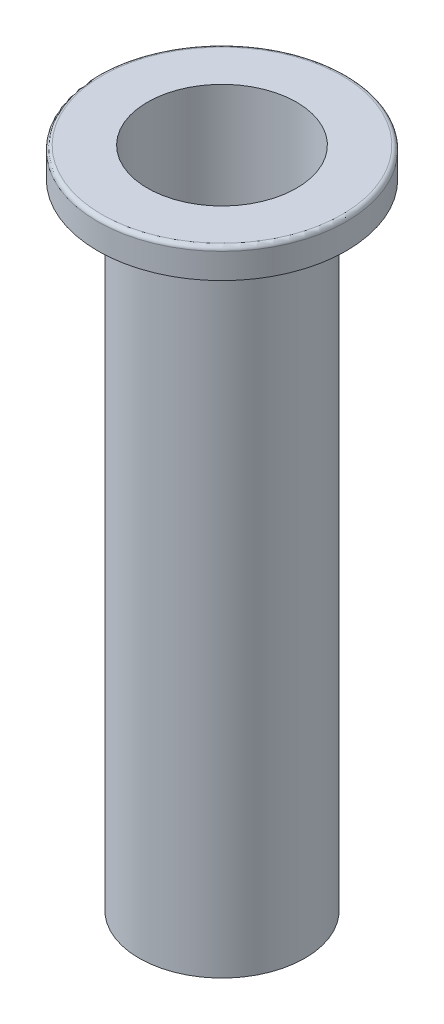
ISO-10303-21;
HEADER;
FILE_DESCRIPTION(('STEP AP214'),'2;1');
FILE_NAME('part.step','',(''),(''),'','','');
FILE_SCHEMA(('AUTOMOTIVE_DESIGN { 1 0 10303 214 1 1 1 1 }'));
ENDSEC;
DATA;
#1=APPLICATION_CONTEXT('core data for automotive mechanical design processes');
#2=APPLICATION_PROTOCOL_DEFINITION('international standard','automotive_design',2000,#1);
#3=PRODUCT_CONTEXT('',#1,'mechanical');
#4=PRODUCT('Part','Part','',(#3));
#5=PRODUCT_RELATED_PRODUCT_CATEGORY('part','',(#4));
#6=PRODUCT_DEFINITION_FORMATION('','',#4);
#7=PRODUCT_DEFINITION_CONTEXT('part definition',#1,'design');
#8=PRODUCT_DEFINITION('design','',#6,#7);
#9=PRODUCT_DEFINITION_SHAPE('','',#8);
#10=(LENGTH_UNIT() NAMED_UNIT(*) SI_UNIT(.MILLI.,.METRE.));
#11=(NAMED_UNIT(*) PLANE_ANGLE_UNIT() SI_UNIT($,.RADIAN.));
#12=(NAMED_UNIT(*) SI_UNIT($,.STERADIAN.) SOLID_ANGLE_UNIT());
#13=UNCERTAINTY_MEASURE_WITH_UNIT(LENGTH_MEASURE(1.E-05),#10,'distance_accuracy_value','');
#14=(GEOMETRIC_REPRESENTATION_CONTEXT(3) GLOBAL_UNCERTAINTY_ASSIGNED_CONTEXT((#13)) GLOBAL_UNIT_ASSIGNED_CONTEXT((#10,
#11,#12)) REPRESENTATION_CONTEXT('',''));
#15=CARTESIAN_POINT('',(0.,0.,0.));
#16=DIRECTION('',(0.,0.,1.));
#17=DIRECTION('',(1.,0.,0.));
#18=AXIS2_PLACEMENT_3D('',#15,#16,#17);
#19=CARTESIAN_POINT('',(0.,-150.,0.));
#20=DIRECTION('',(0.,1.,0.));
#21=DIRECTION('',(0.,0.,1.));
#22=AXIS2_PLACEMENT_3D('',#19,#20,#21);
#23=CYLINDRICAL_SURFACE('',#22,20.);
#24=CARTESIAN_POINT('',(0.,-150.,0.));
#25=DIRECTION('',(0.,1.,0.));
#26=DIRECTION('',(0.,0.,1.));
#27=AXIS2_PLACEMENT_3D('',#24,#25,#26);
#28=CIRCLE('',#27,20.);
#29=CARTESIAN_POINT('',(0.,-150.,20.));
#30=VERTEX_POINT('',#29);
#31=EDGE_CURVE('E51',#30,#30,#28,.T.);
#32=ORIENTED_EDGE('',*,*,#31,.T.);
#33=EDGE_LOOP('',(#32));
#34=FACE_BOUND('',#33,.T.);
#35=CARTESIAN_POINT('',(0.,0.,0.));
#36=DIRECTION('',(0.,1.,0.));
#37=DIRECTION('',(0.,0.,1.));
#38=AXIS2_PLACEMENT_3D('',#35,#36,#37);
#39=CIRCLE('',#38,20.);
#40=CARTESIAN_POINT('',(0.,0.,20.));
#41=VERTEX_POINT('',#40);
#42=EDGE_CURVE('E52',#41,#41,#39,.T.);
#43=ORIENTED_EDGE('',*,*,#42,.F.);
#44=EDGE_LOOP('',(#43));
#45=FACE_BOUND('',#44,.T.);
#46=ADVANCED_FACE('F31',(#34,#45),#23,.T.);
#47=CARTESIAN_POINT('',(0.,-150.,0.));
#48=DIRECTION('',(0.,1.,0.));
#49=DIRECTION('',(0.,0.,1.));
#50=AXIS2_PLACEMENT_3D('',#47,#48,#49);
#51=PLANE('',#50);
#52=CARTESIAN_POINT('',(0.,-150.,0.));
#53=DIRECTION('',(0.,-1.,0.));
#54=DIRECTION('',(0.,0.,-1.));
#55=AXIS2_PLACEMENT_3D('',#52,#53,#54);
#56=CIRCLE('',#55,18.);
#57=CARTESIAN_POINT('',(0.,-150.,-18.));
#58=VERTEX_POINT('',#57);
#59=EDGE_CURVE('E58',#58,#58,#56,.T.);
#60=ORIENTED_EDGE('',*,*,#59,.F.);
#61=EDGE_LOOP('',(#60));
#62=FACE_BOUND('',#61,.T.);
#63=ORIENTED_EDGE('',*,*,#31,.F.);
#64=EDGE_LOOP('',(#63));
#65=FACE_BOUND('',#64,.T.);
#66=ADVANCED_FACE('F74',(#62,#65),#51,.F.);
#67=CARTESIAN_POINT('',(0.,10.,0.));
#68=DIRECTION('',(0.,-1.,0.));
#69=DIRECTION('',(0.,0.,-1.));
#70=AXIS2_PLACEMENT_3D('',#67,#68,#69);
#71=CYLINDRICAL_SURFACE('',#70,30.);
#72=CARTESIAN_POINT('',(0.,9.,0.));
#73=DIRECTION('',(0.,1.,0.));
#74=DIRECTION('',(0.,0.,1.));
#75=AXIS2_PLACEMENT_3D('',#72,#73,#74);
#76=CIRCLE('',#75,30.);
#77=CARTESIAN_POINT('',(0.,9.,30.));
#78=VERTEX_POINT('',#77);
#79=EDGE_CURVE('E10',#78,#78,#76,.F.);
#80=ORIENTED_EDGE('',*,*,#79,.T.);
#81=EDGE_LOOP('',(#80));
#82=FACE_BOUND('',#81,.T.);
#83=CARTESIAN_POINT('',(0.,2.88675134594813,0.));
#84=DIRECTION('',(0.,1.,0.));
#85=DIRECTION('',(0.,0.,1.));
#86=AXIS2_PLACEMENT_3D('',#83,#84,#85);
#87=CIRCLE('',#86,30.);
#88=CARTESIAN_POINT('',(0.,2.88675134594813,30.));
#89=VERTEX_POINT('',#88);
#90=EDGE_CURVE('E46',#89,#89,#87,.T.);
#91=ORIENTED_EDGE('',*,*,#90,.T.);
#92=EDGE_LOOP('',(#91));
#93=FACE_BOUND('',#92,.T.);
#94=ADVANCED_FACE('F77',(#82,#93),#71,.T.);
#95=CARTESIAN_POINT('',(0.,10.,0.));
#96=DIRECTION('',(0.,1.,0.));
#97=DIRECTION('',(0.,0.,1.));
#98=AXIS2_PLACEMENT_3D('',#95,#96,#97);
#99=PLANE('',#98);
#100=CARTESIAN_POINT('',(0.,10.,0.));
#101=DIRECTION('',(0.,1.,0.));
#102=DIRECTION('',(0.,0.,1.));
#103=AXIS2_PLACEMENT_3D('',#100,#101,#102);
#104=CIRCLE('',#103,29.);
#105=CARTESIAN_POINT('',(0.,10.,29.));
#106=VERTEX_POINT('',#105);
#107=EDGE_CURVE('E38',#106,#106,#104,.T.);
#108=ORIENTED_EDGE('',*,*,#107,.T.);
#109=EDGE_LOOP('',(#108));
#110=FACE_BOUND('',#109,.T.);
#111=CARTESIAN_POINT('',(0.,10.,0.));
#112=DIRECTION('',(0.,-1.,0.));
#113=DIRECTION('',(0.,0.,-1.));
#114=AXIS2_PLACEMENT_3D('',#111,#112,#113);
#115=CIRCLE('',#114,18.);
#116=CARTESIAN_POINT('',(0.,10.,-18.));
#117=VERTEX_POINT('',#116);
#118=EDGE_CURVE('E55',#117,#117,#115,.T.);
#119=ORIENTED_EDGE('',*,*,#118,.T.);
#120=EDGE_LOOP('',(#119));
#121=FACE_BOUND('',#120,.T.);
#122=ADVANCED_FACE('F64',(#110,#121),#99,.T.);
#123=CARTESIAN_POINT('',(0.,0.,0.));
#124=DIRECTION('',(0.,1.,0.));
#125=DIRECTION('',(0.,0.,1.));
#126=AXIS2_PLACEMENT_3D('',#123,#124,#125);
#127=PLANE('',#126);
#128=CARTESIAN_POINT('',(0.,0.,0.));
#129=DIRECTION('',(0.,1.,0.));
#130=DIRECTION('',(0.,0.,1.));
#131=AXIS2_PLACEMENT_3D('',#128,#129,#130);
#132=CIRCLE('',#131,25.);
#133=CARTESIAN_POINT('',(0.,0.,25.));
#134=VERTEX_POINT('',#133);
#135=EDGE_CURVE('E42',#134,#134,#132,.F.);
#136=ORIENTED_EDGE('',*,*,#135,.T.);
#137=EDGE_LOOP('',(#136));
#138=FACE_BOUND('',#137,.T.);
#139=ORIENTED_EDGE('',*,*,#42,.T.);
#140=EDGE_LOOP('',(#139));
#141=FACE_BOUND('',#140,.T.);
#142=ADVANCED_FACE('F70',(#138,#141),#127,.F.);
#143=CARTESIAN_POINT('',(0.,10.,0.));
#144=DIRECTION('',(0.,-1.,0.));
#145=DIRECTION('',(0.,0.,-1.));
#146=AXIS2_PLACEMENT_3D('',#143,#144,#145);
#147=CYLINDRICAL_SURFACE('',#146,18.);
#148=ORIENTED_EDGE('',*,*,#118,.F.);
#149=EDGE_LOOP('',(#148));
#150=FACE_BOUND('',#149,.T.);
#151=ORIENTED_EDGE('',*,*,#59,.T.);
#152=EDGE_LOOP('',(#151));
#153=FACE_BOUND('',#152,.T.);
#154=ADVANCED_FACE('F66',(#150,#153),#147,.F.);
#155=CARTESIAN_POINT('',(0.,2.88675134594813,0.));
#156=DIRECTION('',(0.,1.,0.));
#157=DIRECTION('',(0.,0.,1.));
#158=AXIS2_PLACEMENT_3D('',#155,#156,#157);
#159=CONICAL_SURFACE('',#158,30.,1.0471975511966);
#160=ORIENTED_EDGE('',*,*,#135,.F.);
#161=EDGE_LOOP('',(#160));
#162=FACE_BOUND('',#161,.T.);
#163=ORIENTED_EDGE('',*,*,#90,.F.);
#164=EDGE_LOOP('',(#163));
#165=FACE_BOUND('',#164,.T.);
#166=ADVANCED_FACE('F69',(#162,#165),#159,.T.);
#167=CARTESIAN_POINT('',(0.,9.,0.));
#168=DIRECTION('',(0.,1.,0.));
#169=DIRECTION('',(0.,0.,1.));
#170=AXIS2_PLACEMENT_3D('',#167,#168,#169);
#171=TOROIDAL_SURFACE('',#170,29.,1.);
#172=ORIENTED_EDGE('',*,*,#79,.F.);
#173=EDGE_LOOP('',(#172));
#174=FACE_BOUND('',#173,.T.);
#175=ORIENTED_EDGE('',*,*,#107,.F.);
#176=EDGE_LOOP('',(#175));
#177=FACE_BOUND('',#176,.T.);
#178=ADVANCED_FACE('F33',(#174,#177),#171,.T.);
#179=CLOSED_SHELL('',(#46,#66,#94,#122,#142,#154,#166,#178));
#180=MANIFOLD_SOLID_BREP('B2',#179);
#181=ADVANCED_BREP_SHAPE_REPRESENTATION('',(#18,#180),#14);
#182=SHAPE_DEFINITION_REPRESENTATION(#9,#181);
ENDSEC;
END-ISO-10303-21;
